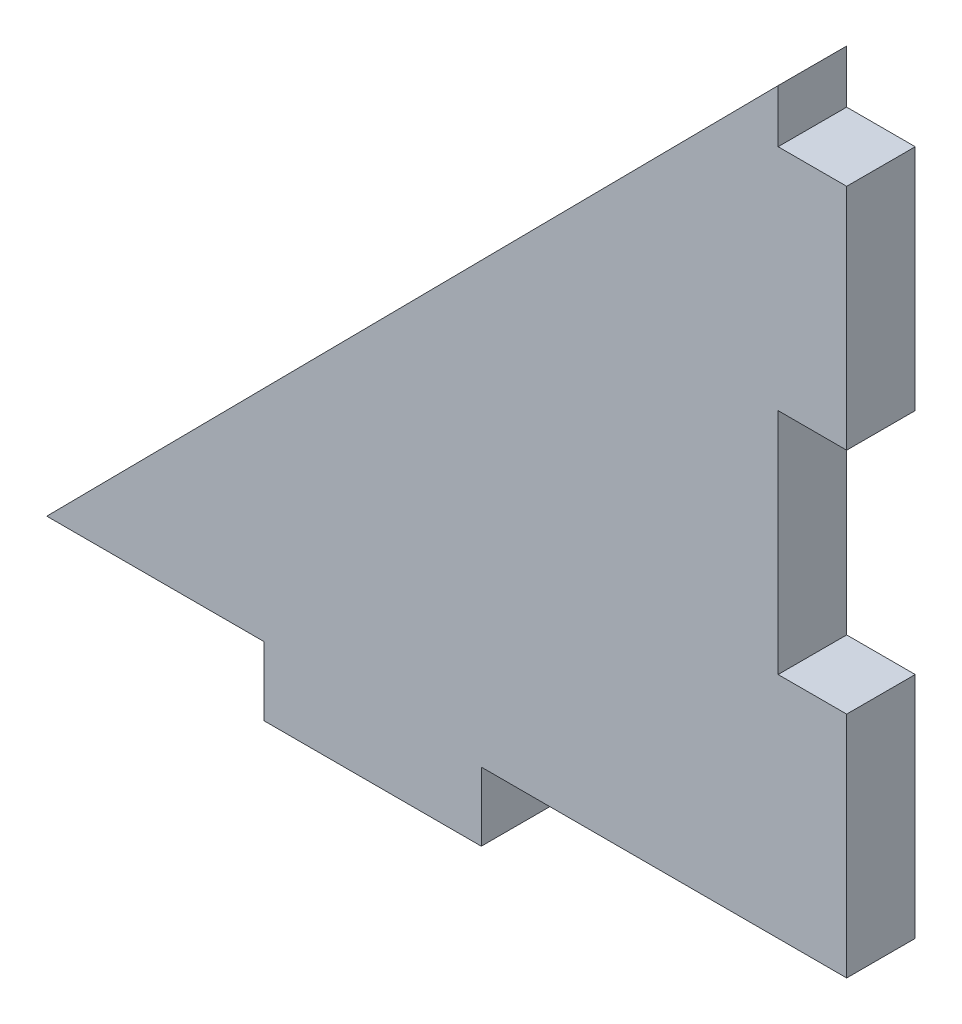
from build123d import *

# Parameters (mm, degrees)
BOSS_EXTRU_1_DEPTH = 3


with BuildPart() as part:
    # Esquisse1 → Boss.-Extru.1 (new body)
    with BuildSketch(Plane.XY):
        Polygon((-32, 8), (-22.492848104, 8), (-22.492848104, 5), (-12.986005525, 5), (-12.986005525, 8), (0, 8), (3, 8), (3, 18), (0, 18), (0, 28), (3, 28), (3, 38), (0, 38), (0, 40.316364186), align=None)
    extrude(amount=BOSS_EXTRU_1_DEPTH)


solid = part.part
